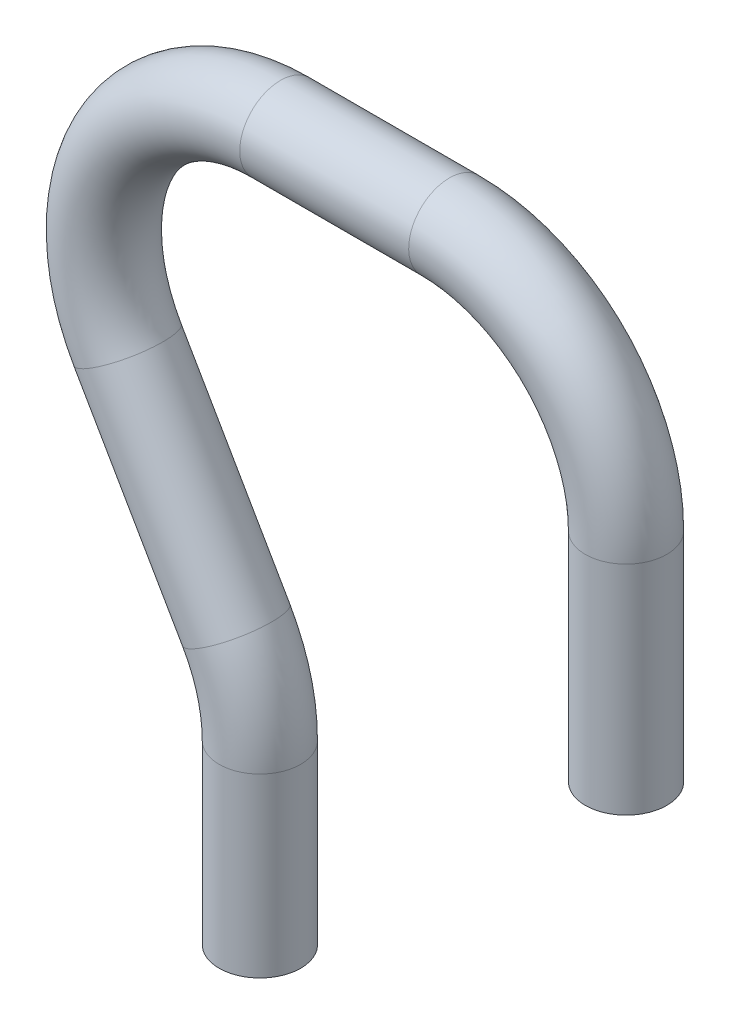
from build123d import *

# Parameters (mm, degrees)
SKETCH2_R   = 4.7625
SKETCH2_R_2 = 3.8735


with BuildPart() as part:
    # Sweep1: sweep along a path in Sketch1
    with BuildLine(Plane.XY) as sweep1_path:
        Line((0, 0), (0, 20.6375))
        ThreePointArc((0, 20.6375), (-0.70320576, 25.978878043), (-2.764900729, 30.95625))
        Line((-2.764900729, 30.95625), (-15.464900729, 52.953295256))
        ThreePointArc((-15.464900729, 52.953295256), (-15.464900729, 73.590795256), (2.407698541, 83.909545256))
        Line((2.407698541, 83.909545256), (22.146200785, 83.909545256))
        ThreePointArc((22.146200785, 83.909545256), (36.739116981, 77.864961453), (42.783700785, 63.272045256))
        Line((42.783700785, 63.272045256), (42.783700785, 37.872045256))
    # Sketch2 → Sweep1 (sweep)
    with BuildSketch(Plane(origin=(0, 0, 0), x_dir=(1, 0, 0), z_dir=(0, 1, 0))):
        Circle(SKETCH2_R)
        Circle(SKETCH2_R_2, mode=Mode.SUBTRACT)
    sweep(path=sweep1_path.line)


solid = part.part
